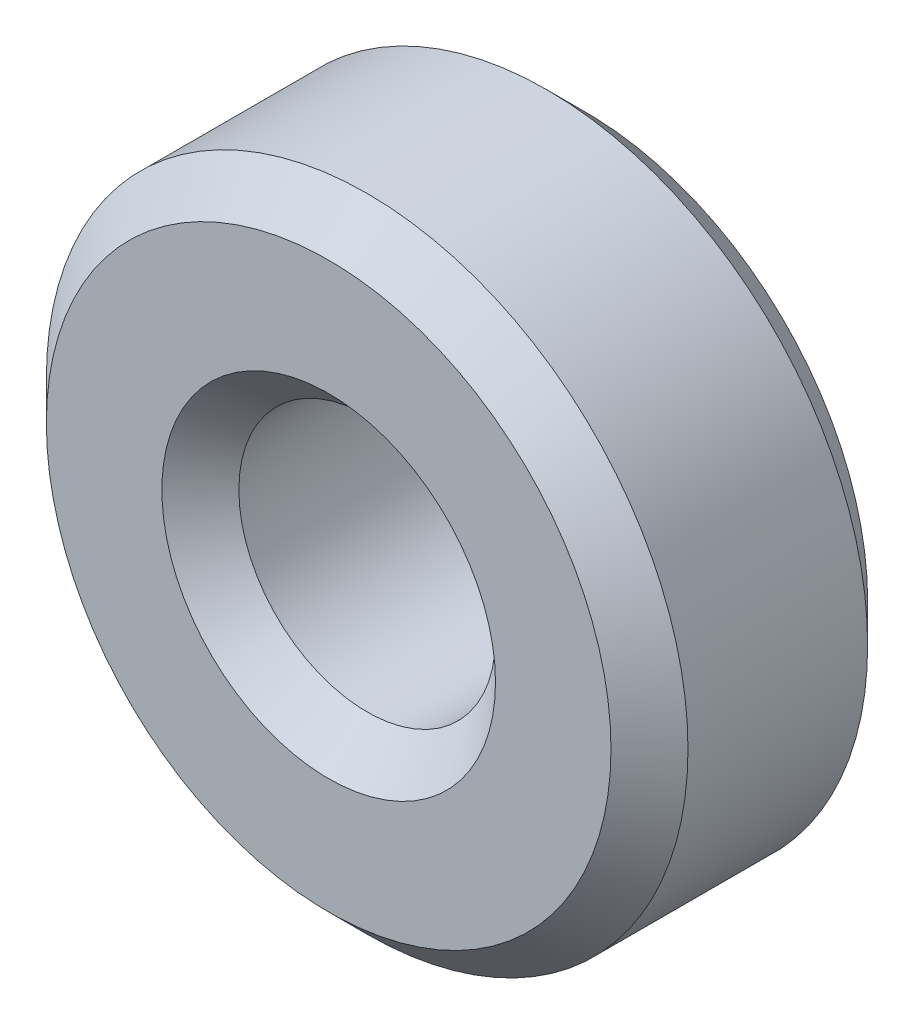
ISO-10303-21;
HEADER;
FILE_DESCRIPTION(('STEP AP214'),'2;1');
FILE_NAME('part.step','',(''),(''),'','','');
FILE_SCHEMA(('AUTOMOTIVE_DESIGN { 1 0 10303 214 1 1 1 1 }'));
ENDSEC;
DATA;
#1=APPLICATION_CONTEXT('core data for automotive mechanical design processes');
#2=APPLICATION_PROTOCOL_DEFINITION('international standard','automotive_design',2000,#1);
#3=PRODUCT_CONTEXT('',#1,'mechanical');
#4=PRODUCT('Part','Part','',(#3));
#5=PRODUCT_RELATED_PRODUCT_CATEGORY('part','',(#4));
#6=PRODUCT_DEFINITION_FORMATION('','',#4);
#7=PRODUCT_DEFINITION_CONTEXT('part definition',#1,'design');
#8=PRODUCT_DEFINITION('design','',#6,#7);
#9=PRODUCT_DEFINITION_SHAPE('','',#8);
#10=(LENGTH_UNIT() NAMED_UNIT(*) SI_UNIT(.MILLI.,.METRE.));
#11=(NAMED_UNIT(*) PLANE_ANGLE_UNIT() SI_UNIT($,.RADIAN.));
#12=(NAMED_UNIT(*) SI_UNIT($,.STERADIAN.) SOLID_ANGLE_UNIT());
#13=UNCERTAINTY_MEASURE_WITH_UNIT(LENGTH_MEASURE(1.E-05),#10,'distance_accuracy_value','');
#14=(GEOMETRIC_REPRESENTATION_CONTEXT(3) GLOBAL_UNCERTAINTY_ASSIGNED_CONTEXT((#13)) GLOBAL_UNIT_ASSIGNED_CONTEXT((#10,
#11,#12)) REPRESENTATION_CONTEXT('',''));
#15=CARTESIAN_POINT('',(0.,0.,0.));
#16=DIRECTION('',(0.,0.,1.));
#17=DIRECTION('',(1.,0.,0.));
#18=AXIS2_PLACEMENT_3D('',#15,#16,#17);
#19=CARTESIAN_POINT('',(0.,0.,2.));
#20=DIRECTION('',(0.,0.,1.));
#21=DIRECTION('',(1.,0.,0.));
#22=AXIS2_PLACEMENT_3D('',#19,#20,#21);
#23=PLANE('',#22);
#24=CARTESIAN_POINT('',(0.,0.,2.));
#25=DIRECTION('',(0.,0.,1.));
#26=DIRECTION('',(1.,0.,0.));
#27=AXIS2_PLACEMENT_3D('',#24,#25,#26);
#28=CIRCLE('',#27,1.3);
#29=CARTESIAN_POINT('',(1.3,0.,2.));
#30=VERTEX_POINT('',#29);
#31=EDGE_CURVE('E52',#30,#30,#28,.F.);
#32=ORIENTED_EDGE('',*,*,#31,.T.);
#33=EDGE_LOOP('',(#32));
#34=FACE_BOUND('',#33,.T.);
#35=CARTESIAN_POINT('',(0.,0.,2.));
#36=DIRECTION('',(0.,0.,1.));
#37=DIRECTION('',(1.,0.,0.));
#38=AXIS2_PLACEMENT_3D('',#35,#36,#37);
#39=CIRCLE('',#38,2.2);
#40=CARTESIAN_POINT('',(-2.2,0.,2.));
#41=VERTEX_POINT('',#40);
#42=EDGE_CURVE('E55',#41,#41,#39,.T.);
#43=ORIENTED_EDGE('',*,*,#42,.T.);
#44=EDGE_LOOP('',(#43));
#45=FACE_BOUND('',#44,.T.);
#46=ADVANCED_FACE('F32',(#34,#45),#23,.T.);
#47=CARTESIAN_POINT('',(0.,0.,0.));
#48=DIRECTION('',(0.,0.,1.));
#49=DIRECTION('',(1.,0.,0.));
#50=AXIS2_PLACEMENT_3D('',#47,#48,#49);
#51=PLANE('',#50);
#52=CARTESIAN_POINT('',(0.,0.,0.));
#53=DIRECTION('',(0.,0.,1.));
#54=DIRECTION('',(1.,0.,0.));
#55=AXIS2_PLACEMENT_3D('',#52,#53,#54);
#56=CIRCLE('',#55,1.3);
#57=CARTESIAN_POINT('',(-1.3,0.,0.));
#58=VERTEX_POINT('',#57);
#59=EDGE_CURVE('E10',#58,#58,#56,.T.);
#60=ORIENTED_EDGE('',*,*,#59,.T.);
#61=EDGE_LOOP('',(#60));
#62=FACE_BOUND('',#61,.T.);
#63=CARTESIAN_POINT('',(0.,0.,0.));
#64=DIRECTION('',(0.,0.,1.));
#65=DIRECTION('',(1.,0.,0.));
#66=AXIS2_PLACEMENT_3D('',#63,#64,#65);
#67=CIRCLE('',#66,2.2);
#68=CARTESIAN_POINT('',(2.2,0.,0.));
#69=VERTEX_POINT('',#68);
#70=EDGE_CURVE('E39',#69,#69,#67,.F.);
#71=ORIENTED_EDGE('',*,*,#70,.T.);
#72=EDGE_LOOP('',(#71));
#73=FACE_BOUND('',#72,.T.);
#74=ADVANCED_FACE('F80',(#62,#73),#51,.F.);
#75=CARTESIAN_POINT('',(0.,0.,2.));
#76=DIRECTION('',(0.,0.,-1.));
#77=DIRECTION('',(-1.,0.,0.));
#78=AXIS2_PLACEMENT_3D('',#75,#76,#77);
#79=CYLINDRICAL_SURFACE('',#78,2.5);
#80=CARTESIAN_POINT('',(0.,0.,1.69999999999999));
#81=DIRECTION('',(0.,0.,1.));
#82=DIRECTION('',(1.,0.,0.));
#83=AXIS2_PLACEMENT_3D('',#80,#81,#82);
#84=CIRCLE('',#83,2.5);
#85=CARTESIAN_POINT('',(-2.5,0.,1.69999999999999));
#86=VERTEX_POINT('',#85);
#87=EDGE_CURVE('E43',#86,#86,#84,.F.);
#88=CARTESIAN_POINT('',(0.,0.,0.300000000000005));
#89=DIRECTION('',(0.,0.,1.));
#90=DIRECTION('',(1.,0.,0.));
#91=AXIS2_PLACEMENT_3D('',#88,#89,#90);
#92=CIRCLE('',#91,2.5);
#93=CARTESIAN_POINT('',(-2.5,0.,0.300000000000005));
#94=VERTEX_POINT('',#93);
#95=EDGE_CURVE('E47',#94,#94,#92,.T.);
#96=CARTESIAN_POINT('',(-2.5,0.,1.69999999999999));
#97=CARTESIAN_POINT('',(-2.5,0.,1.68541666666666));
#98=CARTESIAN_POINT('',(-2.5,0.,1.67083333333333));
#99=CARTESIAN_POINT('',(-2.5,0.,1.64166666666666));
#100=CARTESIAN_POINT('',(-2.5,0.,1.62708333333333));
#101=CARTESIAN_POINT('',(-2.5,0.,1.59791666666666));
#102=CARTESIAN_POINT('',(-2.5,0.,1.58333333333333));
#103=CARTESIAN_POINT('',(-2.5,0.,1.55416666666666));
#104=CARTESIAN_POINT('',(-2.5,0.,1.53958333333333));
#105=CARTESIAN_POINT('',(-2.5,0.,1.51041666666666));
#106=CARTESIAN_POINT('',(-2.5,0.,1.49583333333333));
#107=CARTESIAN_POINT('',(-2.5,0.,1.46666666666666));
#108=CARTESIAN_POINT('',(-2.5,0.,1.45208333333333));
#109=CARTESIAN_POINT('',(-2.5,0.,1.42291666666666));
#110=CARTESIAN_POINT('',(-2.5,0.,1.40833333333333));
#111=CARTESIAN_POINT('',(-2.5,0.,1.37916666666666));
#112=CARTESIAN_POINT('',(-2.5,0.,1.36458333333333));
#113=CARTESIAN_POINT('',(-2.5,0.,1.33541666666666));
#114=CARTESIAN_POINT('',(-2.5,0.,1.32083333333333));
#115=CARTESIAN_POINT('',(-2.5,0.,1.29166666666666));
#116=CARTESIAN_POINT('',(-2.5,0.,1.27708333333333));
#117=CARTESIAN_POINT('',(-2.5,0.,1.24791666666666));
#118=CARTESIAN_POINT('',(-2.5,0.,1.23333333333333));
#119=CARTESIAN_POINT('',(-2.5,0.,1.20416666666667));
#120=CARTESIAN_POINT('',(-2.5,0.,1.18958333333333));
#121=CARTESIAN_POINT('',(-2.5,0.,1.16041666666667));
#122=CARTESIAN_POINT('',(-2.5,0.,1.14583333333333));
#123=CARTESIAN_POINT('',(-2.5,0.,1.11666666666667));
#124=CARTESIAN_POINT('',(-2.5,0.,1.10208333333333));
#125=CARTESIAN_POINT('',(-2.5,0.,1.07291666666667));
#126=CARTESIAN_POINT('',(-2.5,0.,1.05833333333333));
#127=CARTESIAN_POINT('',(-2.5,0.,1.02916666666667));
#128=CARTESIAN_POINT('',(-2.5,0.,1.01458333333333));
#129=CARTESIAN_POINT('',(-2.5,0.,0.985416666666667));
#130=CARTESIAN_POINT('',(-2.5,0.,0.970833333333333));
#131=CARTESIAN_POINT('',(-2.5,0.,0.941666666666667));
#132=CARTESIAN_POINT('',(-2.5,0.,0.927083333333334));
#133=CARTESIAN_POINT('',(-2.5,0.,0.897916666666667));
#134=CARTESIAN_POINT('',(-2.5,0.,0.883333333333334));
#135=CARTESIAN_POINT('',(-2.5,0.,0.854166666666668));
#136=CARTESIAN_POINT('',(-2.5,0.,0.839583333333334));
#137=CARTESIAN_POINT('',(-2.5,0.,0.810416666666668));
#138=CARTESIAN_POINT('',(-2.5,0.,0.795833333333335));
#139=CARTESIAN_POINT('',(-2.5,0.,0.766666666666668));
#140=CARTESIAN_POINT('',(-2.5,0.,0.752083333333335));
#141=CARTESIAN_POINT('',(-2.5,0.,0.722916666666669));
#142=CARTESIAN_POINT('',(-2.5,0.,0.708333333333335));
#143=CARTESIAN_POINT('',(-2.5,0.,0.679166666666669));
#144=CARTESIAN_POINT('',(-2.5,0.,0.664583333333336));
#145=CARTESIAN_POINT('',(-2.5,0.,0.635416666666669));
#146=CARTESIAN_POINT('',(-2.5,0.,0.620833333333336));
#147=CARTESIAN_POINT('',(-2.5,0.,0.591666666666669));
#148=CARTESIAN_POINT('',(-2.5,0.,0.577083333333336));
#149=CARTESIAN_POINT('',(-2.5,0.,0.54791666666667));
#150=CARTESIAN_POINT('',(-2.5,0.,0.533333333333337));
#151=CARTESIAN_POINT('',(-2.5,0.,0.50416666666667));
#152=CARTESIAN_POINT('',(-2.5,0.,0.489583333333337));
#153=CARTESIAN_POINT('',(-2.5,0.,0.46041666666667));
#154=CARTESIAN_POINT('',(-2.5,0.,0.445833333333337));
#155=CARTESIAN_POINT('',(-2.5,0.,0.416666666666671));
#156=CARTESIAN_POINT('',(-2.5,0.,0.402083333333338));
#157=CARTESIAN_POINT('',(-2.5,0.,0.372916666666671));
#158=CARTESIAN_POINT('',(-2.5,0.,0.358333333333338));
#159=CARTESIAN_POINT('',(-2.5,0.,0.329166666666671));
#160=CARTESIAN_POINT('',(-2.5,0.,0.314583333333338));
#161=CARTESIAN_POINT('',(-2.5,0.,0.300000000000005));
#162=B_SPLINE_CURVE_WITH_KNOTS('',3,(#96,#97,#98,#99,#100,#101,#102,#103,#104,#105,#106,#107,
#108,#109,#110,#111,#112,#113,#114,#115,#116,#117,#118,#119,#120,#121,#122,#123,#124,#125,#126,
#127,#128,#129,#130,#131,#132,#133,#134,#135,#136,#137,#138,#139,#140,#141,#142,#143,#144,#145,
#146,#147,#148,#149,#150,#151,#152,#153,#154,#155,#156,#157,#158,#159,#160,#161),.UNSPECIFIED.,
.F.,.F.,(4,2,2,2,2,2,2,2,2,2,2,2,2,2,2,2,2,2,2,2,2,2,2,2,2,2,2,2,2,2,2,2,4),(0.,
0.0437499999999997,0.0874999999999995,0.131249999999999,0.174999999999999,0.218749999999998,
0.262499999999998,0.306249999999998,0.349999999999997,0.393749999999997,0.437499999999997,
0.481249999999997,0.524999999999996,0.568749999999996,0.612499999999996,0.656249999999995,
0.699999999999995,0.743749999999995,0.787499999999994,0.831249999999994,0.874999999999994,
0.918749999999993,0.962499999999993,1.00624999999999,1.04999999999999,1.09374999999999,
1.13749999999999,1.18124999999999,1.22499999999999,1.26874999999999,1.31249999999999,
1.35624999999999,1.39999999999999),.UNSPECIFIED.);
#163=EDGE_CURVE('BSEAM86',#86,#94,#162,.T.);
#164=ORIENTED_EDGE('',*,*,#87,.T.);
#165=ORIENTED_EDGE('',*,*,#95,.T.);
#166=ORIENTED_EDGE('',*,*,#163,.T.);
#167=ORIENTED_EDGE('',*,*,#163,.F.);
#168=EDGE_LOOP('',(#164,#166,#165,#167));
#169=FACE_BOUND('',#168,.T.);
#170=ADVANCED_FACE('F86',(#169),#79,.T.);
#171=CARTESIAN_POINT('',(0.,0.,2.));
#172=DIRECTION('',(0.,0.,-1.));
#173=DIRECTION('',(-1.,0.,0.));
#174=AXIS2_PLACEMENT_3D('',#171,#172,#173);
#175=CYLINDRICAL_SURFACE('',#174,1.);
#176=CARTESIAN_POINT('',(0.,0.,1.69999999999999));
#177=DIRECTION('',(0.,0.,1.));
#178=DIRECTION('',(1.,0.,0.));
#179=AXIS2_PLACEMENT_3D('',#176,#177,#178);
#180=CIRCLE('',#179,1.);
#181=CARTESIAN_POINT('',(-1.,0.,1.69999999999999));
#182=VERTEX_POINT('',#181);
#183=EDGE_CURVE('E58',#182,#182,#180,.T.);
#184=CARTESIAN_POINT('',(0.,0.,0.300000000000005));
#185=DIRECTION('',(0.,0.,1.));
#186=DIRECTION('',(1.,0.,0.));
#187=AXIS2_PLACEMENT_3D('',#184,#185,#186);
#188=CIRCLE('',#187,1.);
#189=CARTESIAN_POINT('',(-1.,0.,0.300000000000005));
#190=VERTEX_POINT('',#189);
#191=EDGE_CURVE('E61',#190,#190,#188,.F.);
#192=CARTESIAN_POINT('',(-1.,0.,1.69999999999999));
#193=CARTESIAN_POINT('',(-1.,0.,1.68541666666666));
#194=CARTESIAN_POINT('',(-1.,0.,1.67083333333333));
#195=CARTESIAN_POINT('',(-1.,0.,1.64166666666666));
#196=CARTESIAN_POINT('',(-1.,0.,1.62708333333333));
#197=CARTESIAN_POINT('',(-1.,0.,1.59791666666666));
#198=CARTESIAN_POINT('',(-1.,0.,1.58333333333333));
#199=CARTESIAN_POINT('',(-1.,0.,1.55416666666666));
#200=CARTESIAN_POINT('',(-1.,0.,1.53958333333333));
#201=CARTESIAN_POINT('',(-1.,0.,1.51041666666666));
#202=CARTESIAN_POINT('',(-1.,0.,1.49583333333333));
#203=CARTESIAN_POINT('',(-1.,0.,1.46666666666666));
#204=CARTESIAN_POINT('',(-1.,0.,1.45208333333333));
#205=CARTESIAN_POINT('',(-1.,0.,1.42291666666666));
#206=CARTESIAN_POINT('',(-1.,0.,1.40833333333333));
#207=CARTESIAN_POINT('',(-1.,0.,1.37916666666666));
#208=CARTESIAN_POINT('',(-1.,0.,1.36458333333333));
#209=CARTESIAN_POINT('',(-1.,0.,1.33541666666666));
#210=CARTESIAN_POINT('',(-1.,0.,1.32083333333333));
#211=CARTESIAN_POINT('',(-1.,0.,1.29166666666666));
#212=CARTESIAN_POINT('',(-1.,0.,1.27708333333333));
#213=CARTESIAN_POINT('',(-1.,0.,1.24791666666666));
#214=CARTESIAN_POINT('',(-1.,0.,1.23333333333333));
#215=CARTESIAN_POINT('',(-1.,0.,1.20416666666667));
#216=CARTESIAN_POINT('',(-1.,0.,1.18958333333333));
#217=CARTESIAN_POINT('',(-1.,0.,1.16041666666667));
#218=CARTESIAN_POINT('',(-1.,0.,1.14583333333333));
#219=CARTESIAN_POINT('',(-1.,0.,1.11666666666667));
#220=CARTESIAN_POINT('',(-1.,0.,1.10208333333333));
#221=CARTESIAN_POINT('',(-1.,0.,1.07291666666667));
#222=CARTESIAN_POINT('',(-1.,0.,1.05833333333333));
#223=CARTESIAN_POINT('',(-1.,0.,1.02916666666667));
#224=CARTESIAN_POINT('',(-1.,0.,1.01458333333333));
#225=CARTESIAN_POINT('',(-1.,0.,0.985416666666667));
#226=CARTESIAN_POINT('',(-1.,0.,0.970833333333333));
#227=CARTESIAN_POINT('',(-1.,0.,0.941666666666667));
#228=CARTESIAN_POINT('',(-1.,0.,0.927083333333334));
#229=CARTESIAN_POINT('',(-1.,0.,0.897916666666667));
#230=CARTESIAN_POINT('',(-1.,0.,0.883333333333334));
#231=CARTESIAN_POINT('',(-1.,0.,0.854166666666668));
#232=CARTESIAN_POINT('',(-1.,0.,0.839583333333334));
#233=CARTESIAN_POINT('',(-1.,0.,0.810416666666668));
#234=CARTESIAN_POINT('',(-1.,0.,0.795833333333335));
#235=CARTESIAN_POINT('',(-1.,0.,0.766666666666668));
#236=CARTESIAN_POINT('',(-1.,0.,0.752083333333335));
#237=CARTESIAN_POINT('',(-1.,0.,0.722916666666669));
#238=CARTESIAN_POINT('',(-1.,0.,0.708333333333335));
#239=CARTESIAN_POINT('',(-1.,0.,0.679166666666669));
#240=CARTESIAN_POINT('',(-1.,0.,0.664583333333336));
#241=CARTESIAN_POINT('',(-1.,0.,0.635416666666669));
#242=CARTESIAN_POINT('',(-1.,0.,0.620833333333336));
#243=CARTESIAN_POINT('',(-1.,0.,0.591666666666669));
#244=CARTESIAN_POINT('',(-1.,0.,0.577083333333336));
#245=CARTESIAN_POINT('',(-1.,0.,0.54791666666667));
#246=CARTESIAN_POINT('',(-1.,0.,0.533333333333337));
#247=CARTESIAN_POINT('',(-1.,0.,0.50416666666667));
#248=CARTESIAN_POINT('',(-1.,0.,0.489583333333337));
#249=CARTESIAN_POINT('',(-1.,0.,0.46041666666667));
#250=CARTESIAN_POINT('',(-1.,0.,0.445833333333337));
#251=CARTESIAN_POINT('',(-1.,0.,0.416666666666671));
#252=CARTESIAN_POINT('',(-1.,0.,0.402083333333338));
#253=CARTESIAN_POINT('',(-1.,0.,0.372916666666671));
#254=CARTESIAN_POINT('',(-1.,0.,0.358333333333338));
#255=CARTESIAN_POINT('',(-1.,0.,0.329166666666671));
#256=CARTESIAN_POINT('',(-1.,0.,0.314583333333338));
#257=CARTESIAN_POINT('',(-1.,0.,0.300000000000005));
#258=B_SPLINE_CURVE_WITH_KNOTS('',3,(#192,#193,#194,#195,#196,#197,#198,#199,#200,#201,#202,
#203,#204,#205,#206,#207,#208,#209,#210,#211,#212,#213,#214,#215,#216,#217,#218,#219,#220,#221,
#222,#223,#224,#225,#226,#227,#228,#229,#230,#231,#232,#233,#234,#235,#236,#237,#238,#239,#240,
#241,#242,#243,#244,#245,#246,#247,#248,#249,#250,#251,#252,#253,#254,#255,#256,#257),
.UNSPECIFIED.,.F.,.F.,(4,2,2,2,2,2,2,2,2,2,2,2,2,2,2,2,2,2,2,2,2,2,2,2,2,2,2,2,2,2,2,2,4),(0.,
0.0437499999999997,0.0874999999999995,0.131249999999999,0.174999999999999,0.218749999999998,
0.262499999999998,0.306249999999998,0.349999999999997,0.393749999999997,0.437499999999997,
0.481249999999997,0.524999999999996,0.568749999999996,0.612499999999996,0.656249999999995,
0.699999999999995,0.743749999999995,0.787499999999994,0.831249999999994,0.874999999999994,
0.918749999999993,0.962499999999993,1.00624999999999,1.04999999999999,1.09374999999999,
1.13749999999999,1.18124999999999,1.22499999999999,1.26874999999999,1.31249999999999,
1.35624999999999,1.39999999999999),.UNSPECIFIED.);
#259=EDGE_CURVE('BSEAM65',#182,#190,#258,.T.);
#260=ORIENTED_EDGE('',*,*,#183,.T.);
#261=ORIENTED_EDGE('',*,*,#191,.T.);
#262=ORIENTED_EDGE('',*,*,#259,.T.);
#263=ORIENTED_EDGE('',*,*,#259,.F.);
#264=EDGE_LOOP('',(#260,#262,#261,#263));
#265=FACE_BOUND('',#264,.T.);
#266=ADVANCED_FACE('F65',(#265),#175,.F.);
#267=CARTESIAN_POINT('',(0.,0.,1.69999999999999));
#268=DIRECTION('',(0.,0.,1.));
#269=DIRECTION('',(1.,0.,0.));
#270=AXIS2_PLACEMENT_3D('',#267,#268,#269);
#271=CONICAL_SURFACE('',#270,1.,0.785398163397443);
#272=ORIENTED_EDGE('',*,*,#31,.F.);
#273=EDGE_LOOP('',(#272));
#274=FACE_BOUND('',#273,.T.);
#275=ORIENTED_EDGE('',*,*,#183,.F.);
#276=EDGE_LOOP('',(#275));
#277=FACE_BOUND('',#276,.T.);
#278=ADVANCED_FACE('F76',(#274,#277),#271,.F.);
#279=CARTESIAN_POINT('',(0.,0.,2.));
#280=DIRECTION('',(0.,0.,-1.));
#281=DIRECTION('',(-1.,0.,0.));
#282=AXIS2_PLACEMENT_3D('',#279,#280,#281);
#283=CONICAL_SURFACE('',#282,2.2,0.785398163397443);
#284=CARTESIAN_POINT('',(-2.5,0.,1.69999999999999));
#285=CARTESIAN_POINT('',(-2.496875,0.,1.703125));
#286=CARTESIAN_POINT('',(-2.49375,0.,1.70624999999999));
#287=CARTESIAN_POINT('',(-2.4875,0.,1.7125));
#288=CARTESIAN_POINT('',(-2.484375,0.,1.71562499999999));
#289=CARTESIAN_POINT('',(-2.478125,0.,1.721875));
#290=CARTESIAN_POINT('',(-2.475,0.,1.725));
#291=CARTESIAN_POINT('',(-2.46875,0.,1.73125));
#292=CARTESIAN_POINT('',(-2.465625,0.,1.734375));
#293=CARTESIAN_POINT('',(-2.459375,0.,1.740625));
#294=CARTESIAN_POINT('',(-2.45625,0.,1.74375));
#295=CARTESIAN_POINT('',(-2.45,0.,1.75));
#296=CARTESIAN_POINT('',(-2.446875,0.,1.753125));
#297=CARTESIAN_POINT('',(-2.440625,0.,1.759375));
#298=CARTESIAN_POINT('',(-2.4375,0.,1.7625));
#299=CARTESIAN_POINT('',(-2.43125,0.,1.76875));
#300=CARTESIAN_POINT('',(-2.428125,0.,1.771875));
#301=CARTESIAN_POINT('',(-2.421875,0.,1.778125));
#302=CARTESIAN_POINT('',(-2.41875,0.,1.78125));
#303=CARTESIAN_POINT('',(-2.4125,0.,1.7875));
#304=CARTESIAN_POINT('',(-2.409375,0.,1.790625));
#305=CARTESIAN_POINT('',(-2.403125,0.,1.796875));
#306=CARTESIAN_POINT('',(-2.4,0.,1.8));
#307=CARTESIAN_POINT('',(-2.39375,0.,1.80625));
#308=CARTESIAN_POINT('',(-2.390625,0.,1.809375));
#309=CARTESIAN_POINT('',(-2.384375,0.,1.815625));
#310=CARTESIAN_POINT('',(-2.38125,0.,1.81875));
#311=CARTESIAN_POINT('',(-2.375,0.,1.825));
#312=CARTESIAN_POINT('',(-2.371875,0.,1.828125));
#313=CARTESIAN_POINT('',(-2.365625,0.,1.834375));
#314=CARTESIAN_POINT('',(-2.3625,0.,1.8375));
#315=CARTESIAN_POINT('',(-2.35625,0.,1.84375));
#316=CARTESIAN_POINT('',(-2.353125,0.,1.846875));
#317=CARTESIAN_POINT('',(-2.346875,0.,1.853125));
#318=CARTESIAN_POINT('',(-2.34375,0.,1.85625));
#319=CARTESIAN_POINT('',(-2.3375,0.,1.8625));
#320=CARTESIAN_POINT('',(-2.334375,0.,1.865625));
#321=CARTESIAN_POINT('',(-2.328125,0.,1.871875));
#322=CARTESIAN_POINT('',(-2.325,0.,1.875));
#323=CARTESIAN_POINT('',(-2.31875,0.,1.88125));
#324=CARTESIAN_POINT('',(-2.315625,0.,1.884375));
#325=CARTESIAN_POINT('',(-2.309375,0.,1.890625));
#326=CARTESIAN_POINT('',(-2.30625,0.,1.89375));
#327=CARTESIAN_POINT('',(-2.3,0.,1.9));
#328=CARTESIAN_POINT('',(-2.296875,0.,1.903125));
#329=CARTESIAN_POINT('',(-2.290625,0.,1.909375));
#330=CARTESIAN_POINT('',(-2.2875,0.,1.9125));
#331=CARTESIAN_POINT('',(-2.28125,0.,1.91875));
#332=CARTESIAN_POINT('',(-2.278125,0.,1.921875));
#333=CARTESIAN_POINT('',(-2.271875,0.,1.928125));
#334=CARTESIAN_POINT('',(-2.26875,0.,1.93125));
#335=CARTESIAN_POINT('',(-2.2625,0.,1.9375));
#336=CARTESIAN_POINT('',(-2.259375,0.,1.940625));
#337=CARTESIAN_POINT('',(-2.253125,0.,1.946875));
#338=CARTESIAN_POINT('',(-2.25,0.,1.95));
#339=CARTESIAN_POINT('',(-2.24375,0.,1.95625));
#340=CARTESIAN_POINT('',(-2.240625,0.,1.959375));
#341=CARTESIAN_POINT('',(-2.234375,0.,1.965625));
#342=CARTESIAN_POINT('',(-2.23125,0.,1.96875));
#343=CARTESIAN_POINT('',(-2.225,0.,1.975));
#344=CARTESIAN_POINT('',(-2.221875,0.,1.978125));
#345=CARTESIAN_POINT('',(-2.215625,0.,1.984375));
#346=CARTESIAN_POINT('',(-2.2125,0.,1.9875));
#347=CARTESIAN_POINT('',(-2.20625,0.,1.99375));
#348=CARTESIAN_POINT('',(-2.203125,0.,1.996875));
#349=CARTESIAN_POINT('',(-2.2,0.,2.));
#350=B_SPLINE_CURVE_WITH_KNOTS('',3,(#284,#285,#286,#287,#288,#289,#290,#291,#292,#293,#294,
#295,#296,#297,#298,#299,#300,#301,#302,#303,#304,#305,#306,#307,#308,#309,#310,#311,#312,#313,
#314,#315,#316,#317,#318,#319,#320,#321,#322,#323,#324,#325,#326,#327,#328,#329,#330,#331,#332,
#333,#334,#335,#336,#337,#338,#339,#340,#341,#342,#343,#344,#345,#346,#347,#348,#349),
.UNSPECIFIED.,.F.,.F.,(4,2,2,2,2,2,2,2,2,2,2,2,2,2,2,2,2,2,2,2,2,2,2,2,2,2,2,2,2,2,2,2,4),(0.,
0.0132582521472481,0.0265165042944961,0.039774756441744,0.053033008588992,0.0662912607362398,
0.0795495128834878,0.0928077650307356,0.106066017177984,0.119324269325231,0.132582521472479,
0.145840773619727,0.159099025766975,0.172357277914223,0.185615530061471,0.198873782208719,
0.212132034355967,0.225390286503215,0.238648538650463,0.251906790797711,0.265165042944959,
0.278423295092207,0.291681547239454,0.304939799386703,0.31819805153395,0.331456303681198,
0.344714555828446,0.357972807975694,0.371231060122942,0.38448931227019,0.397747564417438,
0.411005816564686,0.424264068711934),.UNSPECIFIED.);
#351=EDGE_CURVE('BSEAM70',#86,#41,#350,.T.);
#352=ORIENTED_EDGE('',*,*,#87,.F.);
#353=ORIENTED_EDGE('',*,*,#42,.F.);
#354=ORIENTED_EDGE('',*,*,#351,.T.);
#355=ORIENTED_EDGE('',*,*,#351,.F.);
#356=EDGE_LOOP('',(#352,#354,#353,#355));
#357=FACE_BOUND('',#356,.T.);
#358=ADVANCED_FACE('F70',(#357),#283,.T.);
#359=CARTESIAN_POINT('',(0.,0.,0.));
#360=DIRECTION('',(0.,0.,-1.));
#361=DIRECTION('',(-1.,0.,0.));
#362=AXIS2_PLACEMENT_3D('',#359,#360,#361);
#363=CONICAL_SURFACE('',#362,1.3,0.785398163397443);
#364=CARTESIAN_POINT('',(-1.,0.,0.300000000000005));
#365=CARTESIAN_POINT('',(-1.003125,0.,0.296875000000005));
#366=CARTESIAN_POINT('',(-1.00625,0.,0.293750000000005));
#367=CARTESIAN_POINT('',(-1.0125,0.,0.287500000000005));
#368=CARTESIAN_POINT('',(-1.015625,0.,0.284375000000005));
#369=CARTESIAN_POINT('',(-1.021875,0.,0.278125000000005));
#370=CARTESIAN_POINT('',(-1.025,0.,0.275000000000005));
#371=CARTESIAN_POINT('',(-1.03125,0.,0.268750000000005));
#372=CARTESIAN_POINT('',(-1.034375,0.,0.265625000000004));
#373=CARTESIAN_POINT('',(-1.040625,0.,0.259375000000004));
#374=CARTESIAN_POINT('',(-1.04375,0.,0.256250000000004));
#375=CARTESIAN_POINT('',(-1.05,0.,0.250000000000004));
#376=CARTESIAN_POINT('',(-1.053125,0.,0.246875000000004));
#377=CARTESIAN_POINT('',(-1.059375,0.,0.240625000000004));
#378=CARTESIAN_POINT('',(-1.0625,0.,0.237500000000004));
#379=CARTESIAN_POINT('',(-1.06875,0.,0.231250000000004));
#380=CARTESIAN_POINT('',(-1.071875,0.,0.228125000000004));
#381=CARTESIAN_POINT('',(-1.078125,0.,0.221875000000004));
#382=CARTESIAN_POINT('',(-1.08125,0.,0.218750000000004));
#383=CARTESIAN_POINT('',(-1.0875,0.,0.212500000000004));
#384=CARTESIAN_POINT('',(-1.090625,0.,0.209375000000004));
#385=CARTESIAN_POINT('',(-1.096875,0.,0.203125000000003));
#386=CARTESIAN_POINT('',(-1.1,0.,0.200000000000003));
#387=CARTESIAN_POINT('',(-1.10625,0.,0.193750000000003));
#388=CARTESIAN_POINT('',(-1.109375,0.,0.190625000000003));
#389=CARTESIAN_POINT('',(-1.115625,0.,0.184375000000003));
#390=CARTESIAN_POINT('',(-1.11875,0.,0.181250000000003));
#391=CARTESIAN_POINT('',(-1.125,0.,0.175000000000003));
#392=CARTESIAN_POINT('',(-1.128125,0.,0.171875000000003));
#393=CARTESIAN_POINT('',(-1.134375,0.,0.165625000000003));
#394=CARTESIAN_POINT('',(-1.1375,0.,0.162500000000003));
#395=CARTESIAN_POINT('',(-1.14375,0.,0.156250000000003));
#396=CARTESIAN_POINT('',(-1.146875,0.,0.153125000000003));
#397=CARTESIAN_POINT('',(-1.153125,0.,0.146875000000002));
#398=CARTESIAN_POINT('',(-1.15625,0.,0.143750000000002));
#399=CARTESIAN_POINT('',(-1.1625,0.,0.137500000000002));
#400=CARTESIAN_POINT('',(-1.165625,0.,0.134375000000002));
#401=CARTESIAN_POINT('',(-1.171875,0.,0.128125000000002));
#402=CARTESIAN_POINT('',(-1.175,0.,0.125000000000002));
#403=CARTESIAN_POINT('',(-1.18125,0.,0.118750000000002));
#404=CARTESIAN_POINT('',(-1.184375,0.,0.115625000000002));
#405=CARTESIAN_POINT('',(-1.190625,0.,0.109375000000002));
#406=CARTESIAN_POINT('',(-1.19375,0.,0.106250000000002));
#407=CARTESIAN_POINT('',(-1.2,0.,0.100000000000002));
#408=CARTESIAN_POINT('',(-1.203125,0.,0.0968750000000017));
#409=CARTESIAN_POINT('',(-1.209375,0.,0.0906250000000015));
#410=CARTESIAN_POINT('',(-1.2125,0.,0.0875000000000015));
#411=CARTESIAN_POINT('',(-1.21875,0.,0.0812500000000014));
#412=CARTESIAN_POINT('',(-1.221875,0.,0.0781250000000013));
#413=CARTESIAN_POINT('',(-1.228125,0.,0.0718750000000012));
#414=CARTESIAN_POINT('',(-1.23125,0.,0.0687500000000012));
#415=CARTESIAN_POINT('',(-1.2375,0.,0.062500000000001));
#416=CARTESIAN_POINT('',(-1.240625,0.,0.059375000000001));
#417=CARTESIAN_POINT('',(-1.246875,0.,0.0531250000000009));
#418=CARTESIAN_POINT('',(-1.25,0.,0.0500000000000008));
#419=CARTESIAN_POINT('',(-1.25625,0.,0.0437500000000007));
#420=CARTESIAN_POINT('',(-1.259375,0.,0.0406250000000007));
#421=CARTESIAN_POINT('',(-1.265625,0.,0.0343750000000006));
#422=CARTESIAN_POINT('',(-1.26875,0.,0.0312500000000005));
#423=CARTESIAN_POINT('',(-1.275,0.,0.0250000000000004));
#424=CARTESIAN_POINT('',(-1.278125,0.,0.0218750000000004));
#425=CARTESIAN_POINT('',(-1.284375,0.,0.0156250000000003));
#426=CARTESIAN_POINT('',(-1.2875,0.,0.0125000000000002));
#427=CARTESIAN_POINT('',(-1.29375,0.,0.00625000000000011));
#428=CARTESIAN_POINT('',(-1.296875,0.,0.00312500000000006));
#429=CARTESIAN_POINT('',(-1.3,0.,0.));
#430=B_SPLINE_CURVE_WITH_KNOTS('',3,(#364,#365,#366,#367,#368,#369,#370,#371,#372,#373,#374,
#375,#376,#377,#378,#379,#380,#381,#382,#383,#384,#385,#386,#387,#388,#389,#390,#391,#392,#393,
#394,#395,#396,#397,#398,#399,#400,#401,#402,#403,#404,#405,#406,#407,#408,#409,#410,#411,#412,
#413,#414,#415,#416,#417,#418,#419,#420,#421,#422,#423,#424,#425,#426,#427,#428,#429),
.UNSPECIFIED.,.F.,.F.,(4,2,2,2,2,2,2,2,2,2,2,2,2,2,2,2,2,2,2,2,2,2,2,2,2,2,2,2,2,2,2,2,4),(0.,
0.0132582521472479,0.0265165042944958,0.0397747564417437,0.0530330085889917,0.0662912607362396,
0.0795495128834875,0.0928077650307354,0.106066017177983,0.119324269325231,0.132582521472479,
0.145840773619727,0.159099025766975,0.172357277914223,0.185615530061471,0.198873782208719,
0.212132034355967,0.225390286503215,0.238648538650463,0.251906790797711,0.265165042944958,
0.278423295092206,0.291681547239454,0.304939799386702,0.31819805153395,0.331456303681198,
0.344714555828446,0.357972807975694,0.371231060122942,0.38448931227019,0.397747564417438,
0.411005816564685,0.424264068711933),.UNSPECIFIED.);
#431=EDGE_CURVE('BSEAM67',#190,#58,#430,.T.);
#432=ORIENTED_EDGE('',*,*,#191,.F.);
#433=ORIENTED_EDGE('',*,*,#59,.F.);
#434=ORIENTED_EDGE('',*,*,#431,.T.);
#435=ORIENTED_EDGE('',*,*,#431,.F.);
#436=EDGE_LOOP('',(#432,#434,#433,#435));
#437=FACE_BOUND('',#436,.T.);
#438=ADVANCED_FACE('F67',(#437),#363,.F.);
#439=CARTESIAN_POINT('',(0.,0.,0.300000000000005));
#440=DIRECTION('',(0.,0.,1.));
#441=DIRECTION('',(1.,0.,0.));
#442=AXIS2_PLACEMENT_3D('',#439,#440,#441);
#443=CONICAL_SURFACE('',#442,2.5,0.785398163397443);
#444=ORIENTED_EDGE('',*,*,#70,.F.);
#445=EDGE_LOOP('',(#444));
#446=FACE_BOUND('',#445,.T.);
#447=ORIENTED_EDGE('',*,*,#95,.F.);
#448=EDGE_LOOP('',(#447));
#449=FACE_BOUND('',#448,.T.);
#450=ADVANCED_FACE('F34',(#446,#449),#443,.T.);
#451=CLOSED_SHELL('',(#46,#74,#170,#266,#278,#358,#438,#450));
#452=MANIFOLD_SOLID_BREP('B2',#451);
#453=ADVANCED_BREP_SHAPE_REPRESENTATION('',(#18,#452),#14);
#454=SHAPE_DEFINITION_REPRESENTATION(#9,#453);
ENDSEC;
END-ISO-10303-21;
